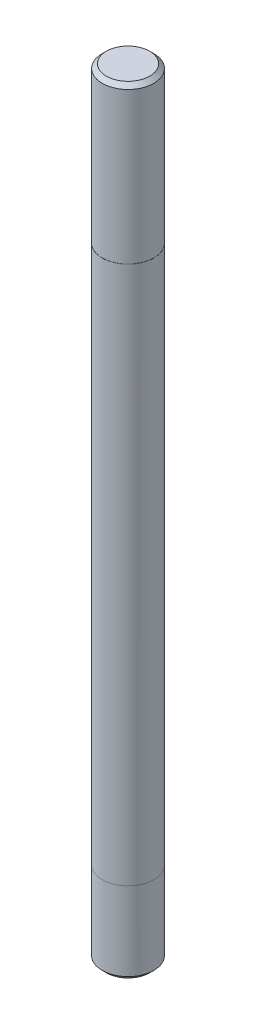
from build123d import *

# Parameters (mm, degrees)
SKETCH1_R          = 2.5
EXTRUDE1_DEPTH     = 75
CUT_EXTRUDE1_START = -15
SKETCH2_R          = 2.5
SKETCH2_R_2        = 2.49
CUT_EXTRUDE1_DEPTH = 15
SKETCH3_R          = 2.5
SKETCH3_R_2        = 2.49
CUT_EXTRUDE2_DEPTH = 8
CHAMFER1_SIZE      = 0.4


with BuildPart() as part:
    # Sketch1 → Extrude1 (new body)
    with BuildSketch(Plane(origin=(0, 0, 0), x_dir=(1, 0, 0), z_dir=(0, 1, 0))):
        with Locations(Location((0, 0, 0), (0, 0, 270))):
            Circle(SKETCH1_R)
    extrude(amount=EXTRUDE1_DEPTH)

    # Sketch2 → Cut-Extrude1 (cut)
    with BuildSketch(Plane(origin=(0, 75, 0), x_dir=(-1, 0, 0), z_dir=(0, 1, 0)).offset(CUT_EXTRUDE1_START)):
        with Locations(Location((0, 0, 0), (0, 0, 90))):
            Circle(SKETCH2_R)
        with Locations(Location((0, 0, 0), (0, 0, 90))):
            Circle(SKETCH2_R_2, mode=Mode.SUBTRACT)
    extrude(amount=CUT_EXTRUDE1_DEPTH, mode=Mode.SUBTRACT)

    # Sketch3 → Cut-Extrude2 (cut)
    with BuildSketch(Plane.XZ):
        with Locations(Location((0, 0, 0), (0, 0, 270))):
            Circle(SKETCH3_R)
        with Locations(Location((0, 0, 0), (0, 0, 90))):
            Circle(SKETCH3_R_2, mode=Mode.SUBTRACT)
    extrude(amount=-CUT_EXTRUDE2_DEPTH, mode=Mode.SUBTRACT)

    # Chamfer1
    chamfer1_edges = [part.edges().sort_by_distance(p)[0] for p in [
        (0, 0, -2.49),
        (0, 75, -2.49),
    ]]
    chamfer(chamfer1_edges, length=CHAMFER1_SIZE)


solid = part.part
